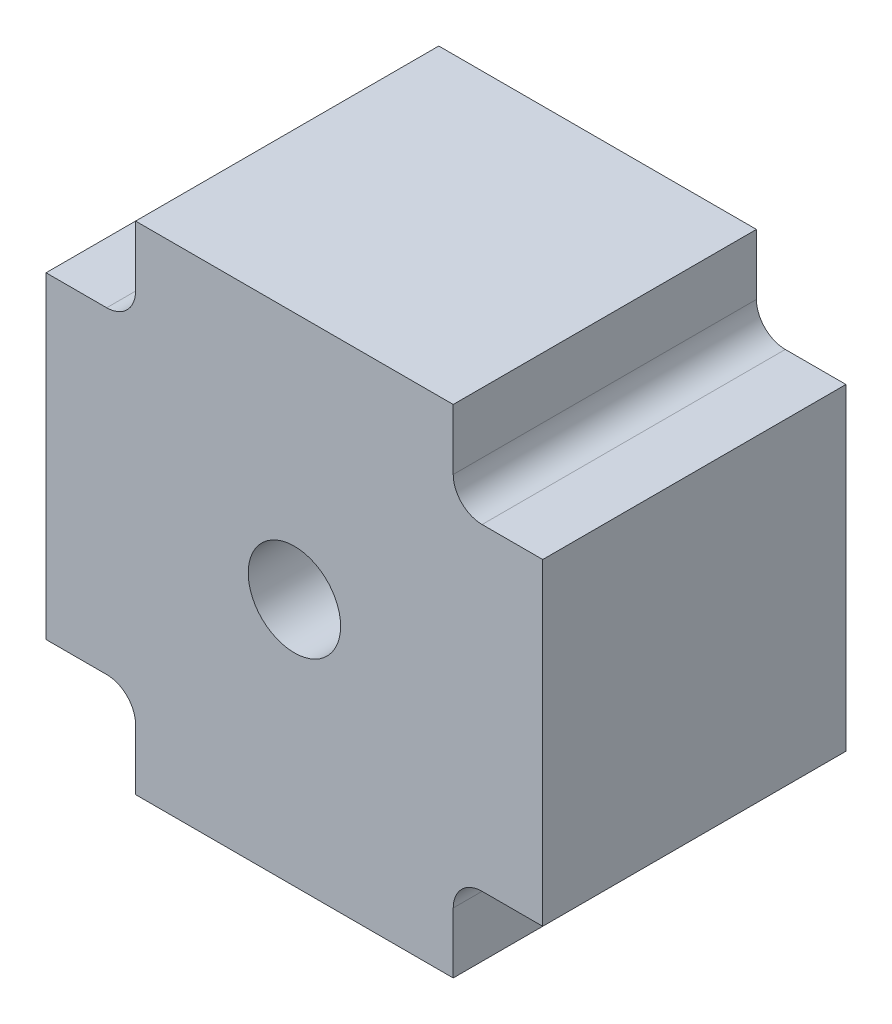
ISO-10303-21;
HEADER;
FILE_DESCRIPTION(('STEP AP214'),'2;1');
FILE_NAME('part.step','',(''),(''),'','','');
FILE_SCHEMA(('AUTOMOTIVE_DESIGN { 1 0 10303 214 1 1 1 1 }'));
ENDSEC;
DATA;
#1=APPLICATION_CONTEXT('core data for automotive mechanical design processes');
#2=APPLICATION_PROTOCOL_DEFINITION('international standard','automotive_design',2000,#1);
#3=PRODUCT_CONTEXT('',#1,'mechanical');
#4=PRODUCT('Part','Part','',(#3));
#5=PRODUCT_RELATED_PRODUCT_CATEGORY('part','',(#4));
#6=PRODUCT_DEFINITION_FORMATION('','',#4);
#7=PRODUCT_DEFINITION_CONTEXT('part definition',#1,'design');
#8=PRODUCT_DEFINITION('design','',#6,#7);
#9=PRODUCT_DEFINITION_SHAPE('','',#8);
#10=(LENGTH_UNIT() NAMED_UNIT(*) SI_UNIT(.MILLI.,.METRE.));
#11=(NAMED_UNIT(*) PLANE_ANGLE_UNIT() SI_UNIT($,.RADIAN.));
#12=(NAMED_UNIT(*) SI_UNIT($,.STERADIAN.) SOLID_ANGLE_UNIT());
#13=UNCERTAINTY_MEASURE_WITH_UNIT(LENGTH_MEASURE(1.E-05),#10,'distance_accuracy_value','');
#14=(GEOMETRIC_REPRESENTATION_CONTEXT(3) GLOBAL_UNCERTAINTY_ASSIGNED_CONTEXT((#13)) GLOBAL_UNIT_ASSIGNED_CONTEXT((#10,
#11,#12)) REPRESENTATION_CONTEXT('',''));
#15=CARTESIAN_POINT('',(0.,0.,0.));
#16=DIRECTION('',(0.,0.,1.));
#17=DIRECTION('',(1.,0.,0.));
#18=AXIS2_PLACEMENT_3D('',#15,#16,#17);
#19=CARTESIAN_POINT('',(-43.,-27.5,52.5));
#20=DIRECTION('',(1.,0.,0.));
#21=DIRECTION('',(0.,0.,-1.));
#22=AXIS2_PLACEMENT_3D('',#19,#20,#21);
#23=PLANE('',#22);
#24=DIRECTION('',(0.,-1.,0.));
#25=VECTOR('',#24,1.);
#26=CARTESIAN_POINT('',(-43.,-27.5,0.));
#27=LINE('',#26,#25);
#28=CARTESIAN_POINT('',(-43.,27.5,0.));
#29=VERTEX_POINT('',#28);
#30=CARTESIAN_POINT('',(-43.,-27.5,0.));
#31=VERTEX_POINT('',#30);
#32=EDGE_CURVE('E173',#29,#31,#27,.T.);
#33=ORIENTED_EDGE('',*,*,#32,.T.);
#34=DIRECTION('',(0.,0.,-1.));
#35=VECTOR('',#34,1.);
#36=CARTESIAN_POINT('',(-43.,-27.5,52.5));
#37=LINE('',#36,#35);
#38=CARTESIAN_POINT('',(-43.,-27.5,52.5));
#39=VERTEX_POINT('',#38);
#40=EDGE_CURVE('E154',#39,#31,#37,.T.);
#41=ORIENTED_EDGE('',*,*,#40,.F.);
#42=DIRECTION('',(0.,-1.,0.));
#43=VECTOR('',#42,1.);
#44=CARTESIAN_POINT('',(-43.,-27.5,52.5));
#45=LINE('',#44,#43);
#46=CARTESIAN_POINT('',(-43.,27.5,52.5));
#47=VERTEX_POINT('',#46);
#48=EDGE_CURVE('E161',#47,#39,#45,.T.);
#49=ORIENTED_EDGE('',*,*,#48,.F.);
#50=DIRECTION('',(0.,0.,-1.));
#51=VECTOR('',#50,1.);
#52=CARTESIAN_POINT('',(-43.,27.5,52.5));
#53=LINE('',#52,#51);
#54=EDGE_CURVE('E250',#47,#29,#53,.T.);
#55=ORIENTED_EDGE('',*,*,#54,.T.);
#56=EDGE_LOOP('',(#33,#41,#49,#55));
#57=FACE_BOUND('',#56,.T.);
#58=ADVANCED_FACE('F35',(#57),#23,.F.);
#59=CARTESIAN_POINT('',(-27.5,-27.5,52.5));
#60=DIRECTION('',(0.,1.,0.));
#61=DIRECTION('',(-1.,0.,0.));
#62=AXIS2_PLACEMENT_3D('',#59,#60,#61);
#63=PLANE('',#62);
#64=DIRECTION('',(1.,0.,0.));
#65=VECTOR('',#64,1.);
#66=CARTESIAN_POINT('',(-27.5,-27.5,0.));
#67=LINE('',#66,#65);
#68=CARTESIAN_POINT('',(-32.5,-27.5,0.));
#69=VERTEX_POINT('',#68);
#70=EDGE_CURVE('E223',#31,#69,#67,.T.);
#71=ORIENTED_EDGE('',*,*,#70,.T.);
#72=DIRECTION('',(0.,0.,-1.));
#73=VECTOR('',#72,1.);
#74=CARTESIAN_POINT('',(-32.5,-27.5,52.5));
#75=LINE('',#74,#73);
#76=CARTESIAN_POINT('',(-32.5,-27.5,52.5));
#77=VERTEX_POINT('',#76);
#78=EDGE_CURVE('E157',#69,#77,#75,.F.);
#79=ORIENTED_EDGE('',*,*,#78,.T.);
#80=DIRECTION('',(1.,0.,0.));
#81=VECTOR('',#80,1.);
#82=CARTESIAN_POINT('',(-27.5,-27.5,52.5));
#83=LINE('',#82,#81);
#84=EDGE_CURVE('E149',#39,#77,#83,.T.);
#85=ORIENTED_EDGE('',*,*,#84,.F.);
#86=ORIENTED_EDGE('',*,*,#40,.T.);
#87=EDGE_LOOP('',(#71,#79,#85,#86));
#88=FACE_BOUND('',#87,.T.);
#89=ADVANCED_FACE('F152',(#88),#63,.F.);
#90=CARTESIAN_POINT('',(-27.5,-43.,52.5));
#91=DIRECTION('',(1.,0.,0.));
#92=DIRECTION('',(0.,1.,0.));
#93=AXIS2_PLACEMENT_3D('',#90,#91,#92);
#94=PLANE('',#93);
#95=DIRECTION('',(0.,-1.,0.));
#96=VECTOR('',#95,1.);
#97=CARTESIAN_POINT('',(-27.5,-43.,52.5));
#98=LINE('',#97,#96);
#99=CARTESIAN_POINT('',(-27.5,-32.5,52.5));
#100=VERTEX_POINT('',#99);
#101=CARTESIAN_POINT('',(-27.5,-43.,52.5));
#102=VERTEX_POINT('',#101);
#103=EDGE_CURVE('E160',#100,#102,#98,.T.);
#104=ORIENTED_EDGE('',*,*,#103,.F.);
#105=DIRECTION('',(0.,0.,-1.));
#106=VECTOR('',#105,1.);
#107=CARTESIAN_POINT('',(-27.5,-32.5,0.));
#108=LINE('',#107,#106);
#109=CARTESIAN_POINT('',(-27.5,-32.5,0.));
#110=VERTEX_POINT('',#109);
#111=EDGE_CURVE('E195',#100,#110,#108,.T.);
#112=ORIENTED_EDGE('',*,*,#111,.T.);
#113=DIRECTION('',(0.,-1.,0.));
#114=VECTOR('',#113,1.);
#115=CARTESIAN_POINT('',(-27.5,-43.,0.));
#116=LINE('',#115,#114);
#117=CARTESIAN_POINT('',(-27.5,-43.,0.));
#118=VERTEX_POINT('',#117);
#119=EDGE_CURVE('E225',#110,#118,#116,.T.);
#120=ORIENTED_EDGE('',*,*,#119,.T.);
#121=DIRECTION('',(0.,0.,-1.));
#122=VECTOR('',#121,1.);
#123=CARTESIAN_POINT('',(-27.5,-43.,52.5));
#124=LINE('',#123,#122);
#125=EDGE_CURVE('E175',#102,#118,#124,.T.);
#126=ORIENTED_EDGE('',*,*,#125,.F.);
#127=EDGE_LOOP('',(#104,#112,#120,#126));
#128=FACE_BOUND('',#127,.T.);
#129=ADVANCED_FACE('F216',(#128),#94,.F.);
#130=CARTESIAN_POINT('',(27.5,-43.,52.5));
#131=DIRECTION('',(0.,1.,0.));
#132=DIRECTION('',(0.,0.,1.));
#133=AXIS2_PLACEMENT_3D('',#130,#131,#132);
#134=PLANE('',#133);
#135=DIRECTION('',(1.,0.,0.));
#136=VECTOR('',#135,1.);
#137=CARTESIAN_POINT('',(27.5,-43.,0.));
#138=LINE('',#137,#136);
#139=CARTESIAN_POINT('',(27.5,-43.,0.));
#140=VERTEX_POINT('',#139);
#141=EDGE_CURVE('E227',#118,#140,#138,.T.);
#142=ORIENTED_EDGE('',*,*,#141,.T.);
#143=DIRECTION('',(0.,0.,-1.));
#144=VECTOR('',#143,1.);
#145=CARTESIAN_POINT('',(27.5,-43.,52.5));
#146=LINE('',#145,#144);
#147=CARTESIAN_POINT('',(27.5,-43.,52.5));
#148=VERTEX_POINT('',#147);
#149=EDGE_CURVE('E181',#148,#140,#146,.T.);
#150=ORIENTED_EDGE('',*,*,#149,.F.);
#151=DIRECTION('',(1.,0.,0.));
#152=VECTOR('',#151,1.);
#153=CARTESIAN_POINT('',(27.5,-43.,52.5));
#154=LINE('',#153,#152);
#155=EDGE_CURVE('E219',#102,#148,#154,.T.);
#156=ORIENTED_EDGE('',*,*,#155,.F.);
#157=ORIENTED_EDGE('',*,*,#125,.T.);
#158=EDGE_LOOP('',(#142,#150,#156,#157));
#159=FACE_BOUND('',#158,.T.);
#160=ADVANCED_FACE('F354',(#159),#134,.F.);
#161=CARTESIAN_POINT('',(27.5,-43.,52.5));
#162=DIRECTION('',(-1.,0.,0.));
#163=DIRECTION('',(0.,-1.,0.));
#164=AXIS2_PLACEMENT_3D('',#161,#162,#163);
#165=PLANE('',#164);
#166=DIRECTION('',(0.,1.,0.));
#167=VECTOR('',#166,1.);
#168=CARTESIAN_POINT('',(27.5,-43.,0.));
#169=LINE('',#168,#167);
#170=CARTESIAN_POINT('',(27.5,-32.5,0.));
#171=VERTEX_POINT('',#170);
#172=EDGE_CURVE('E233',#140,#171,#169,.T.);
#173=ORIENTED_EDGE('',*,*,#172,.T.);
#174=DIRECTION('',(0.,0.,-1.));
#175=VECTOR('',#174,1.);
#176=CARTESIAN_POINT('',(27.5,-32.5,52.5));
#177=LINE('',#176,#175);
#178=CARTESIAN_POINT('',(27.5,-32.5,52.5));
#179=VERTEX_POINT('',#178);
#180=EDGE_CURVE('E193',#171,#179,#177,.F.);
#181=ORIENTED_EDGE('',*,*,#180,.T.);
#182=DIRECTION('',(0.,1.,0.));
#183=VECTOR('',#182,1.);
#184=CARTESIAN_POINT('',(27.5,-43.,52.5));
#185=LINE('',#184,#183);
#186=EDGE_CURVE('E271',#148,#179,#185,.T.);
#187=ORIENTED_EDGE('',*,*,#186,.F.);
#188=ORIENTED_EDGE('',*,*,#149,.T.);
#189=EDGE_LOOP('',(#173,#181,#187,#188));
#190=FACE_BOUND('',#189,.T.);
#191=ADVANCED_FACE('F268',(#190),#165,.F.);
#192=CARTESIAN_POINT('',(43.,-27.5,52.5));
#193=DIRECTION('',(0.,1.,0.));
#194=DIRECTION('',(0.,0.,1.));
#195=AXIS2_PLACEMENT_3D('',#192,#193,#194);
#196=PLANE('',#195);
#197=DIRECTION('',(1.,0.,0.));
#198=VECTOR('',#197,1.);
#199=CARTESIAN_POINT('',(43.,-27.5,52.5));
#200=LINE('',#199,#198);
#201=CARTESIAN_POINT('',(32.5,-27.5,52.5));
#202=VERTEX_POINT('',#201);
#203=CARTESIAN_POINT('',(43.,-27.5,52.5));
#204=VERTEX_POINT('',#203);
#205=EDGE_CURVE('E283',#202,#204,#200,.T.);
#206=ORIENTED_EDGE('',*,*,#205,.F.);
#207=DIRECTION('',(0.,0.,-1.));
#208=VECTOR('',#207,1.);
#209=CARTESIAN_POINT('',(32.5,-27.5,0.));
#210=LINE('',#209,#208);
#211=CARTESIAN_POINT('',(32.5,-27.5,0.));
#212=VERTEX_POINT('',#211);
#213=EDGE_CURVE('E190',#202,#212,#210,.T.);
#214=ORIENTED_EDGE('',*,*,#213,.T.);
#215=DIRECTION('',(1.,0.,0.));
#216=VECTOR('',#215,1.);
#217=CARTESIAN_POINT('',(43.,-27.5,0.));
#218=LINE('',#217,#216);
#219=CARTESIAN_POINT('',(43.,-27.5,0.));
#220=VERTEX_POINT('',#219);
#221=EDGE_CURVE('E236',#212,#220,#218,.T.);
#222=ORIENTED_EDGE('',*,*,#221,.T.);
#223=DIRECTION('',(0.,0.,-1.));
#224=VECTOR('',#223,1.);
#225=CARTESIAN_POINT('',(43.,-27.5,52.5));
#226=LINE('',#225,#224);
#227=EDGE_CURVE('E261',#204,#220,#226,.T.);
#228=ORIENTED_EDGE('',*,*,#227,.F.);
#229=EDGE_LOOP('',(#206,#214,#222,#228));
#230=FACE_BOUND('',#229,.T.);
#231=ADVANCED_FACE('F281',(#230),#196,.F.);
#232=CARTESIAN_POINT('',(43.,-27.5,52.5));
#233=DIRECTION('',(-1.,0.,0.));
#234=DIRECTION('',(0.,0.,1.));
#235=AXIS2_PLACEMENT_3D('',#232,#233,#234);
#236=PLANE('',#235);
#237=DIRECTION('',(0.,1.,0.));
#238=VECTOR('',#237,1.);
#239=CARTESIAN_POINT('',(43.,-27.5,0.));
#240=LINE('',#239,#238);
#241=CARTESIAN_POINT('',(43.,27.5,0.));
#242=VERTEX_POINT('',#241);
#243=EDGE_CURVE('E238',#220,#242,#240,.T.);
#244=ORIENTED_EDGE('',*,*,#243,.T.);
#245=DIRECTION('',(0.,0.,-1.));
#246=VECTOR('',#245,1.);
#247=CARTESIAN_POINT('',(43.,27.5,52.5));
#248=LINE('',#247,#246);
#249=CARTESIAN_POINT('',(43.,27.5,52.5));
#250=VERTEX_POINT('',#249);
#251=EDGE_CURVE('E258',#250,#242,#248,.T.);
#252=ORIENTED_EDGE('',*,*,#251,.F.);
#253=DIRECTION('',(0.,1.,0.));
#254=VECTOR('',#253,1.);
#255=CARTESIAN_POINT('',(43.,-27.5,52.5));
#256=LINE('',#255,#254);
#257=EDGE_CURVE('E285',#204,#250,#256,.T.);
#258=ORIENTED_EDGE('',*,*,#257,.F.);
#259=ORIENTED_EDGE('',*,*,#227,.T.);
#260=EDGE_LOOP('',(#244,#252,#258,#259));
#261=FACE_BOUND('',#260,.T.);
#262=ADVANCED_FACE('F365',(#261),#236,.F.);
#263=CARTESIAN_POINT('',(43.,27.5,52.5));
#264=DIRECTION('',(0.,-1.,0.));
#265=DIRECTION('',(1.,0.,0.));
#266=AXIS2_PLACEMENT_3D('',#263,#264,#265);
#267=PLANE('',#266);
#268=DIRECTION('',(-1.,0.,0.));
#269=VECTOR('',#268,1.);
#270=CARTESIAN_POINT('',(43.,27.5,0.));
#271=LINE('',#270,#269);
#272=CARTESIAN_POINT('',(32.5,27.5,0.));
#273=VERTEX_POINT('',#272);
#274=EDGE_CURVE('E240',#242,#273,#271,.T.);
#275=ORIENTED_EDGE('',*,*,#274,.T.);
#276=DIRECTION('',(0.,0.,-1.));
#277=VECTOR('',#276,1.);
#278=CARTESIAN_POINT('',(32.5,27.5,52.5));
#279=LINE('',#278,#277);
#280=CARTESIAN_POINT('',(32.5,27.5,52.5));
#281=VERTEX_POINT('',#280);
#282=EDGE_CURVE('E178',#273,#281,#279,.F.);
#283=ORIENTED_EDGE('',*,*,#282,.T.);
#284=DIRECTION('',(-1.,0.,0.));
#285=VECTOR('',#284,1.);
#286=CARTESIAN_POINT('',(43.,27.5,52.5));
#287=LINE('',#286,#285);
#288=EDGE_CURVE('E287',#250,#281,#287,.T.);
#289=ORIENTED_EDGE('',*,*,#288,.F.);
#290=ORIENTED_EDGE('',*,*,#251,.T.);
#291=EDGE_LOOP('',(#275,#283,#289,#290));
#292=FACE_BOUND('',#291,.T.);
#293=ADVANCED_FACE('F368',(#292),#267,.F.);
#294=CARTESIAN_POINT('',(27.5,27.5,52.5));
#295=DIRECTION('',(-1.,0.,0.));
#296=DIRECTION('',(0.,-1.,0.));
#297=AXIS2_PLACEMENT_3D('',#294,#295,#296);
#298=PLANE('',#297);
#299=DIRECTION('',(0.,1.,0.));
#300=VECTOR('',#299,1.);
#301=CARTESIAN_POINT('',(27.5,27.5,52.5));
#302=LINE('',#301,#300);
#303=CARTESIAN_POINT('',(27.5,32.5,52.5));
#304=VERTEX_POINT('',#303);
#305=CARTESIAN_POINT('',(27.5,43.,52.5));
#306=VERTEX_POINT('',#305);
#307=EDGE_CURVE('E294',#304,#306,#302,.T.);
#308=ORIENTED_EDGE('',*,*,#307,.F.);
#309=DIRECTION('',(0.,0.,-1.));
#310=VECTOR('',#309,1.);
#311=CARTESIAN_POINT('',(27.5,32.5,0.));
#312=LINE('',#311,#310);
#313=CARTESIAN_POINT('',(27.5,32.5,0.));
#314=VERTEX_POINT('',#313);
#315=EDGE_CURVE('E174',#304,#314,#312,.T.);
#316=ORIENTED_EDGE('',*,*,#315,.T.);
#317=DIRECTION('',(0.,1.,0.));
#318=VECTOR('',#317,1.);
#319=CARTESIAN_POINT('',(27.5,27.5,0.));
#320=LINE('',#319,#318);
#321=CARTESIAN_POINT('',(27.5,43.,0.));
#322=VERTEX_POINT('',#321);
#323=EDGE_CURVE('E243',#314,#322,#320,.T.);
#324=ORIENTED_EDGE('',*,*,#323,.T.);
#325=DIRECTION('',(0.,0.,-1.));
#326=VECTOR('',#325,1.);
#327=CARTESIAN_POINT('',(27.5,43.,52.5));
#328=LINE('',#327,#326);
#329=EDGE_CURVE('E255',#306,#322,#328,.T.);
#330=ORIENTED_EDGE('',*,*,#329,.F.);
#331=EDGE_LOOP('',(#308,#316,#324,#330));
#332=FACE_BOUND('',#331,.T.);
#333=ADVANCED_FACE('F372',(#332),#298,.F.);
#334=CARTESIAN_POINT('',(27.5,43.,52.5));
#335=DIRECTION('',(0.,-1.,0.));
#336=DIRECTION('',(0.,0.,-1.));
#337=AXIS2_PLACEMENT_3D('',#334,#335,#336);
#338=PLANE('',#337);
#339=DIRECTION('',(-1.,0.,0.));
#340=VECTOR('',#339,1.);
#341=CARTESIAN_POINT('',(27.5,43.,0.));
#342=LINE('',#341,#340);
#343=CARTESIAN_POINT('',(-27.5,43.,0.));
#344=VERTEX_POINT('',#343);
#345=EDGE_CURVE('E245',#322,#344,#342,.T.);
#346=ORIENTED_EDGE('',*,*,#345,.T.);
#347=DIRECTION('',(0.,0.,-1.));
#348=VECTOR('',#347,1.);
#349=CARTESIAN_POINT('',(-27.5,43.,52.5));
#350=LINE('',#349,#348);
#351=CARTESIAN_POINT('',(-27.5,43.,52.5));
#352=VERTEX_POINT('',#351);
#353=EDGE_CURVE('E252',#352,#344,#350,.T.);
#354=ORIENTED_EDGE('',*,*,#353,.F.);
#355=DIRECTION('',(-1.,0.,0.));
#356=VECTOR('',#355,1.);
#357=CARTESIAN_POINT('',(27.5,43.,52.5));
#358=LINE('',#357,#356);
#359=EDGE_CURVE('E296',#306,#352,#358,.T.);
#360=ORIENTED_EDGE('',*,*,#359,.F.);
#361=ORIENTED_EDGE('',*,*,#329,.T.);
#362=EDGE_LOOP('',(#346,#354,#360,#361));
#363=FACE_BOUND('',#362,.T.);
#364=ADVANCED_FACE('F315',(#363),#338,.F.);
#365=CARTESIAN_POINT('',(-27.5,27.5,52.5));
#366=DIRECTION('',(1.,0.,0.));
#367=DIRECTION('',(0.,0.,-1.));
#368=AXIS2_PLACEMENT_3D('',#365,#366,#367);
#369=PLANE('',#368);
#370=DIRECTION('',(0.,-1.,0.));
#371=VECTOR('',#370,1.);
#372=CARTESIAN_POINT('',(-27.5,27.5,0.));
#373=LINE('',#372,#371);
#374=CARTESIAN_POINT('',(-27.5,32.5,0.));
#375=VERTEX_POINT('',#374);
#376=EDGE_CURVE('E247',#344,#375,#373,.T.);
#377=ORIENTED_EDGE('',*,*,#376,.T.);
#378=DIRECTION('',(0.,0.,-1.));
#379=VECTOR('',#378,1.);
#380=CARTESIAN_POINT('',(-27.5,32.5,52.5));
#381=LINE('',#380,#379);
#382=CARTESIAN_POINT('',(-27.5,32.5,52.5));
#383=VERTEX_POINT('',#382);
#384=EDGE_CURVE('E51',#375,#383,#381,.F.);
#385=ORIENTED_EDGE('',*,*,#384,.T.);
#386=DIRECTION('',(0.,-1.,0.));
#387=VECTOR('',#386,1.);
#388=CARTESIAN_POINT('',(-27.5,27.5,52.5));
#389=LINE('',#388,#387);
#390=EDGE_CURVE('E298',#352,#383,#389,.T.);
#391=ORIENTED_EDGE('',*,*,#390,.F.);
#392=ORIENTED_EDGE('',*,*,#353,.T.);
#393=EDGE_LOOP('',(#377,#385,#391,#392));
#394=FACE_BOUND('',#393,.T.);
#395=ADVANCED_FACE('F307',(#394),#369,.F.);
#396=CARTESIAN_POINT('',(-27.5,27.5,52.5));
#397=DIRECTION('',(0.,-1.,0.));
#398=DIRECTION('',(1.,0.,0.));
#399=AXIS2_PLACEMENT_3D('',#396,#397,#398);
#400=PLANE('',#399);
#401=DIRECTION('',(-1.,0.,0.));
#402=VECTOR('',#401,1.);
#403=CARTESIAN_POINT('',(-27.5,27.5,52.5));
#404=LINE('',#403,#402);
#405=CARTESIAN_POINT('',(-32.5,27.5,52.5));
#406=VERTEX_POINT('',#405);
#407=EDGE_CURVE('E166',#406,#47,#404,.T.);
#408=ORIENTED_EDGE('',*,*,#407,.F.);
#409=DIRECTION('',(0.,0.,-1.));
#410=VECTOR('',#409,1.);
#411=CARTESIAN_POINT('',(-32.5,27.5,0.));
#412=LINE('',#411,#410);
#413=CARTESIAN_POINT('',(-32.5,27.5,0.));
#414=VERTEX_POINT('',#413);
#415=EDGE_CURVE('E199',#406,#414,#412,.T.);
#416=ORIENTED_EDGE('',*,*,#415,.T.);
#417=DIRECTION('',(-1.,0.,0.));
#418=VECTOR('',#417,1.);
#419=CARTESIAN_POINT('',(-27.5,27.5,0.));
#420=LINE('',#419,#418);
#421=EDGE_CURVE('E170',#414,#29,#420,.T.);
#422=ORIENTED_EDGE('',*,*,#421,.T.);
#423=ORIENTED_EDGE('',*,*,#54,.F.);
#424=EDGE_LOOP('',(#408,#416,#422,#423));
#425=FACE_BOUND('',#424,.T.);
#426=ADVANCED_FACE('F305',(#425),#400,.F.);
#427=CARTESIAN_POINT('',(0.,0.,52.5));
#428=DIRECTION('',(0.,0.,1.));
#429=DIRECTION('',(1.,0.,0.));
#430=AXIS2_PLACEMENT_3D('',#427,#428,#429);
#431=PLANE('',#430);
#432=CARTESIAN_POINT('',(0.,0.,52.5));
#433=DIRECTION('',(0.,0.,1.));
#434=DIRECTION('',(1.,0.,0.));
#435=AXIS2_PLACEMENT_3D('',#432,#433,#434);
#436=CIRCLE('',#435,8.);
#437=CARTESIAN_POINT('',(8.,0.,52.5));
#438=VERTEX_POINT('',#437);
#439=EDGE_CURVE('E351',#438,#438,#436,.T.);
#440=ORIENTED_EDGE('',*,*,#439,.F.);
#441=EDGE_LOOP('',(#440));
#442=FACE_BOUND('',#441,.T.);
#443=ORIENTED_EDGE('',*,*,#48,.T.);
#444=ORIENTED_EDGE('',*,*,#84,.T.);
#445=CARTESIAN_POINT('',(-32.5,-32.5,52.5));
#446=DIRECTION('',(0.,0.,1.));
#447=DIRECTION('',(1.,0.,0.));
#448=AXIS2_PLACEMENT_3D('',#445,#446,#447);
#449=CIRCLE('',#448,5.);
#450=EDGE_CURVE('E209',#77,#100,#449,.F.);
#451=ORIENTED_EDGE('',*,*,#450,.T.);
#452=ORIENTED_EDGE('',*,*,#103,.T.);
#453=ORIENTED_EDGE('',*,*,#155,.T.);
#454=ORIENTED_EDGE('',*,*,#186,.T.);
#455=CARTESIAN_POINT('',(32.5,-32.5,52.5));
#456=DIRECTION('',(0.,0.,1.));
#457=DIRECTION('',(1.,0.,0.));
#458=AXIS2_PLACEMENT_3D('',#455,#456,#457);
#459=CIRCLE('',#458,5.);
#460=EDGE_CURVE('E205',#179,#202,#459,.F.);
#461=ORIENTED_EDGE('',*,*,#460,.T.);
#462=ORIENTED_EDGE('',*,*,#205,.T.);
#463=ORIENTED_EDGE('',*,*,#257,.T.);
#464=ORIENTED_EDGE('',*,*,#288,.T.);
#465=CARTESIAN_POINT('',(32.5,32.5,52.5));
#466=DIRECTION('',(0.,0.,1.));
#467=DIRECTION('',(1.,0.,0.));
#468=AXIS2_PLACEMENT_3D('',#465,#466,#467);
#469=CIRCLE('',#468,5.);
#470=EDGE_CURVE('E188',#281,#304,#469,.F.);
#471=ORIENTED_EDGE('',*,*,#470,.T.);
#472=ORIENTED_EDGE('',*,*,#307,.T.);
#473=ORIENTED_EDGE('',*,*,#359,.T.);
#474=ORIENTED_EDGE('',*,*,#390,.T.);
#475=CARTESIAN_POINT('',(-32.5,32.5,52.5));
#476=DIRECTION('',(0.,0.,1.));
#477=DIRECTION('',(1.,0.,0.));
#478=AXIS2_PLACEMENT_3D('',#475,#476,#477);
#479=CIRCLE('',#478,5.);
#480=EDGE_CURVE('E11',#383,#406,#479,.F.);
#481=ORIENTED_EDGE('',*,*,#480,.T.);
#482=ORIENTED_EDGE('',*,*,#407,.T.);
#483=EDGE_LOOP('',(#443,#444,#451,#452,#453,#454,#461,#462,#463,#464,#471,#472,#473,#474,#481,#482));
#484=FACE_BOUND('',#483,.T.);
#485=ADVANCED_FACE('F164',(#442,#484),#431,.T.);
#486=CARTESIAN_POINT('',(0.,0.,0.));
#487=DIRECTION('',(0.,0.,1.));
#488=DIRECTION('',(1.,0.,0.));
#489=AXIS2_PLACEMENT_3D('',#486,#487,#488);
#490=PLANE('',#489);
#491=CARTESIAN_POINT('',(0.,0.,0.));
#492=DIRECTION('',(0.,0.,1.));
#493=DIRECTION('',(1.,0.,0.));
#494=AXIS2_PLACEMENT_3D('',#491,#492,#493);
#495=CIRCLE('',#494,8.);
#496=CARTESIAN_POINT('',(8.,0.,0.));
#497=VERTEX_POINT('',#496);
#498=EDGE_CURVE('E39',#497,#497,#495,.T.);
#499=ORIENTED_EDGE('',*,*,#498,.T.);
#500=EDGE_LOOP('',(#499));
#501=FACE_BOUND('',#500,.T.);
#502=ORIENTED_EDGE('',*,*,#32,.F.);
#503=ORIENTED_EDGE('',*,*,#421,.F.);
#504=CARTESIAN_POINT('',(-32.5,32.5,0.));
#505=DIRECTION('',(0.,0.,1.));
#506=DIRECTION('',(1.,0.,0.));
#507=AXIS2_PLACEMENT_3D('',#504,#505,#506);
#508=CIRCLE('',#507,5.);
#509=EDGE_CURVE('E44',#414,#375,#508,.T.);
#510=ORIENTED_EDGE('',*,*,#509,.T.);
#511=ORIENTED_EDGE('',*,*,#376,.F.);
#512=ORIENTED_EDGE('',*,*,#345,.F.);
#513=ORIENTED_EDGE('',*,*,#323,.F.);
#514=CARTESIAN_POINT('',(32.5,32.5,0.));
#515=DIRECTION('',(0.,0.,1.));
#516=DIRECTION('',(1.,0.,0.));
#517=AXIS2_PLACEMENT_3D('',#514,#515,#516);
#518=CIRCLE('',#517,5.);
#519=EDGE_CURVE('E186',#314,#273,#518,.T.);
#520=ORIENTED_EDGE('',*,*,#519,.T.);
#521=ORIENTED_EDGE('',*,*,#274,.F.);
#522=ORIENTED_EDGE('',*,*,#243,.F.);
#523=ORIENTED_EDGE('',*,*,#221,.F.);
#524=CARTESIAN_POINT('',(32.5,-32.5,0.));
#525=DIRECTION('',(0.,0.,1.));
#526=DIRECTION('',(1.,0.,0.));
#527=AXIS2_PLACEMENT_3D('',#524,#525,#526);
#528=CIRCLE('',#527,5.);
#529=EDGE_CURVE('E203',#212,#171,#528,.T.);
#530=ORIENTED_EDGE('',*,*,#529,.T.);
#531=ORIENTED_EDGE('',*,*,#172,.F.);
#532=ORIENTED_EDGE('',*,*,#141,.F.);
#533=ORIENTED_EDGE('',*,*,#119,.F.);
#534=CARTESIAN_POINT('',(-32.5,-32.5,0.));
#535=DIRECTION('',(0.,0.,1.));
#536=DIRECTION('',(1.,0.,0.));
#537=AXIS2_PLACEMENT_3D('',#534,#535,#536);
#538=CIRCLE('',#537,5.);
#539=EDGE_CURVE('E207',#110,#69,#538,.T.);
#540=ORIENTED_EDGE('',*,*,#539,.T.);
#541=ORIENTED_EDGE('',*,*,#70,.F.);
#542=EDGE_LOOP('',(#502,#503,#510,#511,#512,#513,#520,#521,#522,#523,#530,#531,#532,#533,#540,#541));
#543=FACE_BOUND('',#542,.T.);
#544=ADVANCED_FACE('F222',(#501,#543),#490,.F.);
#545=CARTESIAN_POINT('',(32.5,32.5,52.5));
#546=DIRECTION('',(0.,0.,1.));
#547=DIRECTION('',(1.,0.,0.));
#548=AXIS2_PLACEMENT_3D('',#545,#546,#547);
#549=CYLINDRICAL_SURFACE('',#548,5.);
#550=ORIENTED_EDGE('',*,*,#470,.F.);
#551=ORIENTED_EDGE('',*,*,#282,.F.);
#552=ORIENTED_EDGE('',*,*,#519,.F.);
#553=ORIENTED_EDGE('',*,*,#315,.F.);
#554=EDGE_LOOP('',(#550,#551,#552,#553));
#555=FACE_BOUND('',#554,.T.);
#556=ADVANCED_FACE('F326',(#555),#549,.F.);
#557=CARTESIAN_POINT('',(32.5,-32.5,52.5));
#558=DIRECTION('',(0.,0.,1.));
#559=DIRECTION('',(1.,0.,0.));
#560=AXIS2_PLACEMENT_3D('',#557,#558,#559);
#561=CYLINDRICAL_SURFACE('',#560,5.);
#562=ORIENTED_EDGE('',*,*,#460,.F.);
#563=ORIENTED_EDGE('',*,*,#180,.F.);
#564=ORIENTED_EDGE('',*,*,#529,.F.);
#565=ORIENTED_EDGE('',*,*,#213,.F.);
#566=EDGE_LOOP('',(#562,#563,#564,#565));
#567=FACE_BOUND('',#566,.T.);
#568=ADVANCED_FACE('F278',(#567),#561,.F.);
#569=CARTESIAN_POINT('',(-32.5,-32.5,52.5));
#570=DIRECTION('',(0.,0.,1.));
#571=DIRECTION('',(1.,0.,0.));
#572=AXIS2_PLACEMENT_3D('',#569,#570,#571);
#573=CYLINDRICAL_SURFACE('',#572,5.);
#574=ORIENTED_EDGE('',*,*,#450,.F.);
#575=ORIENTED_EDGE('',*,*,#78,.F.);
#576=ORIENTED_EDGE('',*,*,#539,.F.);
#577=ORIENTED_EDGE('',*,*,#111,.F.);
#578=EDGE_LOOP('',(#574,#575,#576,#577));
#579=FACE_BOUND('',#578,.T.);
#580=ADVANCED_FACE('F221',(#579),#573,.F.);
#581=CARTESIAN_POINT('',(-32.5,32.5,52.5));
#582=DIRECTION('',(0.,0.,1.));
#583=DIRECTION('',(1.,0.,0.));
#584=AXIS2_PLACEMENT_3D('',#581,#582,#583);
#585=CYLINDRICAL_SURFACE('',#584,5.);
#586=ORIENTED_EDGE('',*,*,#480,.F.);
#587=ORIENTED_EDGE('',*,*,#384,.F.);
#588=ORIENTED_EDGE('',*,*,#509,.F.);
#589=ORIENTED_EDGE('',*,*,#415,.F.);
#590=EDGE_LOOP('',(#586,#587,#588,#589));
#591=FACE_BOUND('',#590,.T.);
#592=ADVANCED_FACE('F37',(#591),#585,.F.);
#593=CARTESIAN_POINT('',(0.,0.,-4.5));
#594=DIRECTION('',(0.,0.,1.));
#595=DIRECTION('',(1.,0.,0.));
#596=AXIS2_PLACEMENT_3D('',#593,#594,#595);
#597=CYLINDRICAL_SURFACE('',#596,8.);
#598=CARTESIAN_POINT('',(8.,0.,52.5));
#599=CARTESIAN_POINT('',(8.,0.,51.953125));
#600=CARTESIAN_POINT('',(8.,0.,51.40625));
#601=CARTESIAN_POINT('',(8.,0.,50.3125));
#602=CARTESIAN_POINT('',(8.,0.,49.765625));
#603=CARTESIAN_POINT('',(8.,0.,48.671875));
#604=CARTESIAN_POINT('',(8.,0.,48.125));
#605=CARTESIAN_POINT('',(8.,0.,47.03125));
#606=CARTESIAN_POINT('',(8.,0.,46.484375));
#607=CARTESIAN_POINT('',(8.,0.,45.390625));
#608=CARTESIAN_POINT('',(8.,0.,44.84375));
#609=CARTESIAN_POINT('',(8.,0.,43.75));
#610=CARTESIAN_POINT('',(8.,0.,43.203125));
#611=CARTESIAN_POINT('',(8.,0.,42.109375));
#612=CARTESIAN_POINT('',(8.,0.,41.5625));
#613=CARTESIAN_POINT('',(8.,0.,40.46875));
#614=CARTESIAN_POINT('',(8.,0.,39.921875));
#615=CARTESIAN_POINT('',(8.,0.,38.828125));
#616=CARTESIAN_POINT('',(8.,0.,38.28125));
#617=CARTESIAN_POINT('',(8.,0.,37.1875));
#618=CARTESIAN_POINT('',(8.,0.,36.640625));
#619=CARTESIAN_POINT('',(8.,0.,35.546875));
#620=CARTESIAN_POINT('',(8.,0.,35.));
#621=CARTESIAN_POINT('',(8.,0.,33.90625));
#622=CARTESIAN_POINT('',(8.,0.,33.359375));
#623=CARTESIAN_POINT('',(8.,0.,32.265625));
#624=CARTESIAN_POINT('',(8.,0.,31.71875));
#625=CARTESIAN_POINT('',(8.,0.,30.625));
#626=CARTESIAN_POINT('',(8.,0.,30.078125));
#627=CARTESIAN_POINT('',(8.,0.,28.984375));
#628=CARTESIAN_POINT('',(8.,0.,28.4375));
#629=CARTESIAN_POINT('',(8.,0.,27.34375));
#630=CARTESIAN_POINT('',(8.,0.,26.796875));
#631=CARTESIAN_POINT('',(8.,0.,25.703125));
#632=CARTESIAN_POINT('',(8.,0.,25.15625));
#633=CARTESIAN_POINT('',(8.,0.,24.0625));
#634=CARTESIAN_POINT('',(8.,0.,23.515625));
#635=CARTESIAN_POINT('',(8.,0.,22.421875));
#636=CARTESIAN_POINT('',(8.,0.,21.875));
#637=CARTESIAN_POINT('',(8.,0.,20.78125));
#638=CARTESIAN_POINT('',(8.,0.,20.234375));
#639=CARTESIAN_POINT('',(8.,0.,19.140625));
#640=CARTESIAN_POINT('',(8.,0.,18.59375));
#641=CARTESIAN_POINT('',(8.,0.,17.5));
#642=CARTESIAN_POINT('',(8.,0.,16.953125));
#643=CARTESIAN_POINT('',(8.,0.,15.859375));
#644=CARTESIAN_POINT('',(8.,0.,15.3125));
#645=CARTESIAN_POINT('',(8.,0.,14.21875));
#646=CARTESIAN_POINT('',(8.,0.,13.671875));
#647=CARTESIAN_POINT('',(8.,0.,12.578125));
#648=CARTESIAN_POINT('',(8.,0.,12.03125));
#649=CARTESIAN_POINT('',(8.,0.,10.9375));
#650=CARTESIAN_POINT('',(8.,0.,10.390625));
#651=CARTESIAN_POINT('',(8.,0.,9.296875));
#652=CARTESIAN_POINT('',(8.,0.,8.75));
#653=CARTESIAN_POINT('',(8.,0.,7.65625));
#654=CARTESIAN_POINT('',(8.,0.,7.109375));
#655=CARTESIAN_POINT('',(8.,0.,6.015625));
#656=CARTESIAN_POINT('',(8.,0.,5.46875));
#657=CARTESIAN_POINT('',(8.,0.,4.375));
#658=CARTESIAN_POINT('',(8.,0.,3.828125));
#659=CARTESIAN_POINT('',(8.,0.,2.734375));
#660=CARTESIAN_POINT('',(8.,0.,2.1875));
#661=CARTESIAN_POINT('',(8.,0.,1.09375));
#662=CARTESIAN_POINT('',(8.,0.,0.546874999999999));
#663=CARTESIAN_POINT('',(8.,0.,0.));
#664=B_SPLINE_CURVE_WITH_KNOTS('',3,(#598,#599,#600,#601,#602,#603,#604,#605,#606,#607,#608,
#609,#610,#611,#612,#613,#614,#615,#616,#617,#618,#619,#620,#621,#622,#623,#624,#625,#626,#627,
#628,#629,#630,#631,#632,#633,#634,#635,#636,#637,#638,#639,#640,#641,#642,#643,#644,#645,#646,
#647,#648,#649,#650,#651,#652,#653,#654,#655,#656,#657,#658,#659,#660,#661,#662,#663),
.UNSPECIFIED.,.F.,.F.,(4,2,2,2,2,2,2,2,2,2,2,2,2,2,2,2,2,2,2,2,2,2,2,2,2,2,2,2,2,2,2,2,4),(0.,
1.640625,3.28125,4.921875,6.5625,8.203125,9.84375,11.484375,13.125,14.765625,16.40625,18.046875,
19.6875,21.328125,22.96875,24.609375,26.25,27.890625,29.53125,31.171875,32.8125,34.453125,
36.09375,37.734375,39.375,41.015625,42.65625,44.296875,45.9375,47.578125,49.21875,50.859375,
52.5),.UNSPECIFIED.);
#665=EDGE_CURVE('BSEAM335',#438,#497,#664,.T.);
#666=ORIENTED_EDGE('',*,*,#439,.T.);
#667=ORIENTED_EDGE('',*,*,#498,.F.);
#668=ORIENTED_EDGE('',*,*,#665,.T.);
#669=ORIENTED_EDGE('',*,*,#665,.F.);
#670=EDGE_LOOP('',(#666,#668,#667,#669));
#671=FACE_BOUND('',#670,.T.);
#672=ADVANCED_FACE('F335',(#671),#597,.F.);
#673=CLOSED_SHELL('',(#58,#89,#129,#160,#191,#231,#262,#293,#333,#364,#395,#426,#485,#544,#556,
#568,#580,#592,#672));
#674=MANIFOLD_SOLID_BREP('B2',#673);
#675=ADVANCED_BREP_SHAPE_REPRESENTATION('',(#18,#674),#14);
#676=SHAPE_DEFINITION_REPRESENTATION(#9,#675);
ENDSEC;
END-ISO-10303-21;
